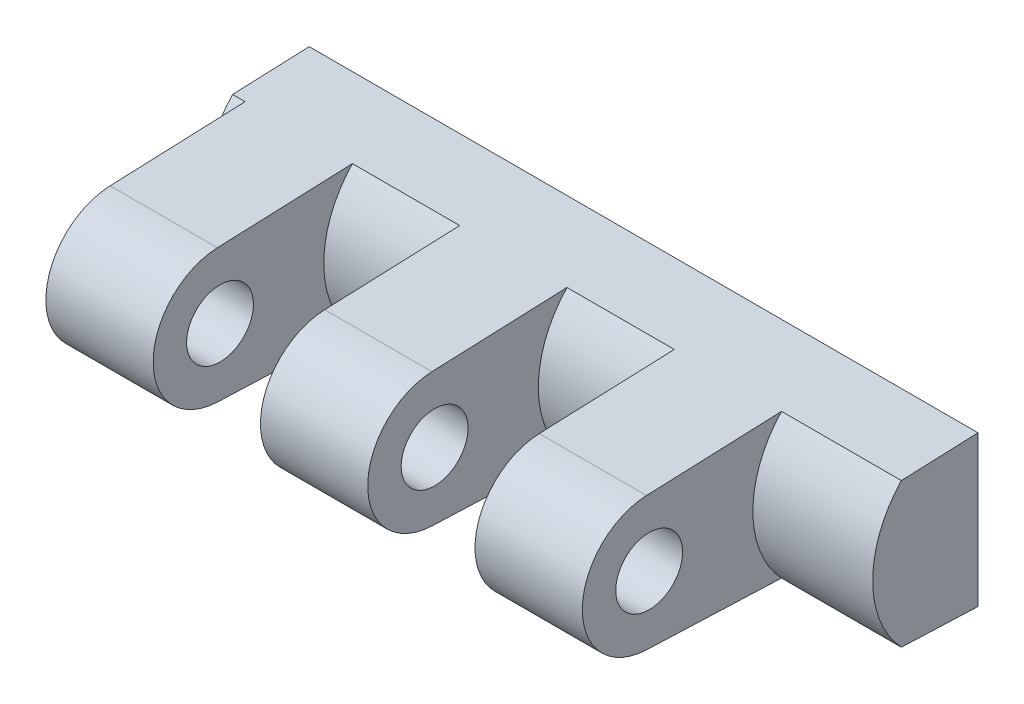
ISO-10303-21;
HEADER;
FILE_DESCRIPTION(('STEP AP214'),'2;1');
FILE_NAME('part.step','',(''),(''),'','','');
FILE_SCHEMA(('AUTOMOTIVE_DESIGN { 1 0 10303 214 1 1 1 1 }'));
ENDSEC;
DATA;
#1=APPLICATION_CONTEXT('core data for automotive mechanical design processes');
#2=APPLICATION_PROTOCOL_DEFINITION('international standard','automotive_design',2000,#1);
#3=PRODUCT_CONTEXT('',#1,'mechanical');
#4=PRODUCT('Part','Part','',(#3));
#5=PRODUCT_RELATED_PRODUCT_CATEGORY('part','',(#4));
#6=PRODUCT_DEFINITION_FORMATION('','',#4);
#7=PRODUCT_DEFINITION_CONTEXT('part definition',#1,'design');
#8=PRODUCT_DEFINITION('design','',#6,#7);
#9=PRODUCT_DEFINITION_SHAPE('','',#8);
#10=(LENGTH_UNIT() NAMED_UNIT(*) SI_UNIT(.MILLI.,.METRE.));
#11=(NAMED_UNIT(*) PLANE_ANGLE_UNIT() SI_UNIT($,.RADIAN.));
#12=(NAMED_UNIT(*) SI_UNIT($,.STERADIAN.) SOLID_ANGLE_UNIT());
#13=UNCERTAINTY_MEASURE_WITH_UNIT(LENGTH_MEASURE(1.E-05),#10,'distance_accuracy_value','');
#14=(GEOMETRIC_REPRESENTATION_CONTEXT(3) GLOBAL_UNCERTAINTY_ASSIGNED_CONTEXT((#13)) GLOBAL_UNIT_ASSIGNED_CONTEXT((#10,
#11,#12)) REPRESENTATION_CONTEXT('',''));
#15=CARTESIAN_POINT('',(0.,0.,0.));
#16=DIRECTION('',(0.,0.,1.));
#17=DIRECTION('',(1.,0.,0.));
#18=AXIS2_PLACEMENT_3D('',#15,#16,#17);
#19=CARTESIAN_POINT('',(-10.25,-4.5,0.));
#20=DIRECTION('',(0.,-0.99921100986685,0.0397159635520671));
#21=DIRECTION('',(0.,0.0397159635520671,0.999211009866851));
#22=AXIS2_PLACEMENT_3D('',#19,#20,#21);
#23=PLANE('',#22);
#24=DIRECTION('',(1.,0.,0.));
#25=VECTOR('',#24,1.);
#26=CARTESIAN_POINT('',(-40.,-4.31777704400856,4.58453396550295));
#27=LINE('',#26,#25);
#28=CARTESIAN_POINT('',(-10.,-4.31777704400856,4.58453396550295));
#29=VERTEX_POINT('',#28);
#30=CARTESIAN_POINT('',(-9.25,-4.31777704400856,4.58453396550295));
#31=VERTEX_POINT('',#30);
#32=EDGE_CURVE('E175',#29,#31,#27,.T.);
#33=ORIENTED_EDGE('',*,*,#32,.F.);
#34=DIRECTION('',(0.,0.0397159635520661,0.99921100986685));
#35=VECTOR('',#34,1.);
#36=CARTESIAN_POINT('',(-10.,-4.5,0.));
#37=LINE('',#36,#35);
#38=CARTESIAN_POINT('',(-10.,-4.5,0.));
#39=VERTEX_POINT('',#38);
#40=EDGE_CURVE('E29',#39,#29,#37,.T.);
#41=ORIENTED_EDGE('',*,*,#40,.F.);
#42=DIRECTION('',(1.,0.,0.));
#43=VECTOR('',#42,1.);
#44=CARTESIAN_POINT('',(-10.25,-4.5,0.));
#45=LINE('',#44,#43);
#46=CARTESIAN_POINT('',(30.,-4.5,0.));
#47=VERTEX_POINT('',#46);
#48=EDGE_CURVE('E202',#39,#47,#45,.T.);
#49=ORIENTED_EDGE('',*,*,#48,.T.);
#50=DIRECTION('',(0.,-0.0397159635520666,-0.99921100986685));
#51=VECTOR('',#50,1.);
#52=CARTESIAN_POINT('',(30.,-4.31777704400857,4.58453396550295));
#53=LINE('',#52,#51);
#54=CARTESIAN_POINT('',(30.,-4.31777704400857,4.58453396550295));
#55=VERTEX_POINT('',#54);
#56=EDGE_CURVE('E287',#55,#47,#53,.T.);
#57=ORIENTED_EDGE('',*,*,#56,.F.);
#58=DIRECTION('',(1.,0.,0.));
#59=VECTOR('',#58,1.);
#60=CARTESIAN_POINT('',(-40.,-4.31777704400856,4.58453396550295));
#61=LINE('',#60,#59);
#62=CARTESIAN_POINT('',(22.833333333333,-4.31777704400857,4.58453396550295));
#63=VERTEX_POINT('',#62);
#64=EDGE_CURVE('E172',#63,#55,#61,.T.);
#65=ORIENTED_EDGE('',*,*,#64,.F.);
#66=DIRECTION('',(0.,-0.0397159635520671,-0.999211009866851));
#67=VECTOR('',#66,1.);
#68=CARTESIAN_POINT('',(22.833333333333,-4.5,0.));
#69=LINE('',#68,#67);
#70=CARTESIAN_POINT('',(22.833333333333,-3.9968440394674,12.658863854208));
#71=VERTEX_POINT('',#70);
#72=EDGE_CURVE('E191',#71,#63,#69,.T.);
#73=ORIENTED_EDGE('',*,*,#72,.F.);
#74=DIRECTION('',(1.,0.,0.));
#75=VECTOR('',#74,1.);
#76=CARTESIAN_POINT('',(-10.25,-3.9968440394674,12.658863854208));
#77=LINE('',#76,#75);
#78=CARTESIAN_POINT('',(16.4166666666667,-3.9968440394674,12.658863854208));
#79=VERTEX_POINT('',#78);
#80=EDGE_CURVE('E198',#79,#71,#77,.T.);
#81=ORIENTED_EDGE('',*,*,#80,.F.);
#82=DIRECTION('',(0.,0.0397159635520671,0.999211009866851));
#83=VECTOR('',#82,1.);
#84=CARTESIAN_POINT('',(16.4166666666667,-4.5,0.));
#85=LINE('',#84,#83);
#86=CARTESIAN_POINT('',(16.4166666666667,-4.31777704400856,4.58453396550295));
#87=VERTEX_POINT('',#86);
#88=EDGE_CURVE('E188',#87,#79,#85,.T.);
#89=ORIENTED_EDGE('',*,*,#88,.F.);
#90=DIRECTION('',(1.,0.,0.));
#91=VECTOR('',#90,1.);
#92=CARTESIAN_POINT('',(-40.,-4.31777704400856,4.58453396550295));
#93=LINE('',#92,#91);
#94=CARTESIAN_POINT('',(10.,-4.31777704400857,4.58453396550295));
#95=VERTEX_POINT('',#94);
#96=EDGE_CURVE('E9',#95,#87,#93,.T.);
#97=ORIENTED_EDGE('',*,*,#96,.F.);
#98=DIRECTION('',(0.,-0.0397159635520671,-0.999211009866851));
#99=VECTOR('',#98,1.);
#100=CARTESIAN_POINT('',(10.,-4.5,0.));
#101=LINE('',#100,#99);
#102=CARTESIAN_POINT('',(10.,-3.9968440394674,12.658863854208));
#103=VERTEX_POINT('',#102);
#104=EDGE_CURVE('E185',#103,#95,#101,.T.);
#105=ORIENTED_EDGE('',*,*,#104,.F.);
#106=CARTESIAN_POINT('',(3.5833333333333,-3.9968440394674,12.658863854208));
#107=VERTEX_POINT('',#106);
#108=EDGE_CURVE('E200',#107,#103,#77,.T.);
#109=ORIENTED_EDGE('',*,*,#108,.F.);
#110=DIRECTION('',(0.,0.0397159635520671,0.999211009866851));
#111=VECTOR('',#110,1.);
#112=CARTESIAN_POINT('',(3.5833333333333,-4.5,0.));
#113=LINE('',#112,#111);
#114=CARTESIAN_POINT('',(3.5833333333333,-4.31777704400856,4.58453396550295));
#115=VERTEX_POINT('',#114);
#116=EDGE_CURVE('E183',#115,#107,#113,.T.);
#117=ORIENTED_EDGE('',*,*,#116,.F.);
#118=DIRECTION('',(1.,0.,0.));
#119=VECTOR('',#118,1.);
#120=CARTESIAN_POINT('',(-40.,-4.31777704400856,4.58453396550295));
#121=LINE('',#120,#119);
#122=CARTESIAN_POINT('',(-2.833333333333,-4.31777704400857,4.58453396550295));
#123=VERTEX_POINT('',#122);
#124=EDGE_CURVE('E22',#123,#115,#121,.T.);
#125=ORIENTED_EDGE('',*,*,#124,.F.);
#126=DIRECTION('',(0.,-0.0397159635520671,-0.999211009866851));
#127=VECTOR('',#126,1.);
#128=CARTESIAN_POINT('',(-2.833333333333,-4.5,0.));
#129=LINE('',#128,#127);
#130=CARTESIAN_POINT('',(-2.833333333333,-3.9968440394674,12.658863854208));
#131=VERTEX_POINT('',#130);
#132=EDGE_CURVE('E180',#131,#123,#129,.T.);
#133=ORIENTED_EDGE('',*,*,#132,.F.);
#134=CARTESIAN_POINT('',(-9.25,-3.9968440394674,12.658863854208));
#135=VERTEX_POINT('',#134);
#136=EDGE_CURVE('E201',#135,#131,#77,.T.);
#137=ORIENTED_EDGE('',*,*,#136,.F.);
#138=DIRECTION('',(0.,0.0397159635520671,0.999211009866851));
#139=VECTOR('',#138,1.);
#140=CARTESIAN_POINT('',(-9.25,-4.5,0.));
#141=LINE('',#140,#139);
#142=EDGE_CURVE('E177',#31,#135,#141,.T.);
#143=ORIENTED_EDGE('',*,*,#142,.F.);
#144=EDGE_LOOP('',(#33,#41,#49,#57,#65,#73,#81,#89,#97,#105,#109,#117,#125,#133,#137,#143));
#145=FACE_BOUND('',#144,.T.);
#146=ADVANCED_FACE('F14',(#145),#23,.T.);
#147=CARTESIAN_POINT('',(-10.25,3.9968440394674,12.658863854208));
#148=DIRECTION('',(0.,0.99921100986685,0.0397159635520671));
#149=DIRECTION('',(0.,0.0397159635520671,-0.999211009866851));
#150=AXIS2_PLACEMENT_3D('',#147,#148,#149);
#151=PLANE('',#150);
#152=DIRECTION('',(1.,0.,0.));
#153=VECTOR('',#152,1.);
#154=CARTESIAN_POINT('',(-10.25,4.5,0.));
#155=LINE('',#154,#153);
#156=CARTESIAN_POINT('',(-10.,4.5,0.));
#157=VERTEX_POINT('',#156);
#158=CARTESIAN_POINT('',(30.,4.5,0.));
#159=VERTEX_POINT('',#158);
#160=EDGE_CURVE('E137',#157,#159,#155,.T.);
#161=ORIENTED_EDGE('',*,*,#160,.F.);
#162=DIRECTION('',(0.,0.0397159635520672,-0.99921100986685));
#163=VECTOR('',#162,1.);
#164=CARTESIAN_POINT('',(-10.,4.31777704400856,4.58453396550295));
#165=LINE('',#164,#163);
#166=CARTESIAN_POINT('',(-10.,4.31777704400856,4.58453396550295));
#167=VERTEX_POINT('',#166);
#168=EDGE_CURVE('E127',#167,#157,#165,.T.);
#169=ORIENTED_EDGE('',*,*,#168,.F.);
#170=DIRECTION('',(-1.,0.,0.));
#171=VECTOR('',#170,1.);
#172=CARTESIAN_POINT('',(-40.,4.31777704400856,4.58453396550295));
#173=LINE('',#172,#171);
#174=CARTESIAN_POINT('',(-9.25,4.31777704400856,4.58453396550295));
#175=VERTEX_POINT('',#174);
#176=EDGE_CURVE('E135',#167,#175,#173,.F.);
#177=ORIENTED_EDGE('',*,*,#176,.T.);
#178=DIRECTION('',(0.,-0.0397159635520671,0.999211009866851));
#179=VECTOR('',#178,1.);
#180=CARTESIAN_POINT('',(-9.25,3.9968440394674,12.658863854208));
#181=LINE('',#180,#179);
#182=CARTESIAN_POINT('',(-9.25,3.9968440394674,12.658863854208));
#183=VERTEX_POINT('',#182);
#184=EDGE_CURVE('E144',#175,#183,#181,.T.);
#185=ORIENTED_EDGE('',*,*,#184,.T.);
#186=DIRECTION('',(1.,0.,0.));
#187=VECTOR('',#186,1.);
#188=CARTESIAN_POINT('',(-10.25,3.9968440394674,12.658863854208));
#189=LINE('',#188,#187);
#190=CARTESIAN_POINT('',(-2.833333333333,3.9968440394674,12.658863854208));
#191=VERTEX_POINT('',#190);
#192=EDGE_CURVE('E197',#183,#191,#189,.T.);
#193=ORIENTED_EDGE('',*,*,#192,.T.);
#194=DIRECTION('',(0.,0.0397159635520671,-0.999211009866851));
#195=VECTOR('',#194,1.);
#196=CARTESIAN_POINT('',(-2.833333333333,3.9968440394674,12.658863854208));
#197=LINE('',#196,#195);
#198=CARTESIAN_POINT('',(-2.833333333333,4.31777704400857,4.58453396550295));
#199=VERTEX_POINT('',#198);
#200=EDGE_CURVE('E237',#191,#199,#197,.T.);
#201=ORIENTED_EDGE('',*,*,#200,.T.);
#202=DIRECTION('',(-1.,0.,0.));
#203=VECTOR('',#202,1.);
#204=CARTESIAN_POINT('',(-40.,4.31777704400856,4.58453396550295));
#205=LINE('',#204,#203);
#206=CARTESIAN_POINT('',(3.5833333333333,4.31777704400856,4.58453396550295));
#207=VERTEX_POINT('',#206);
#208=EDGE_CURVE('E145',#199,#207,#205,.F.);
#209=ORIENTED_EDGE('',*,*,#208,.T.);
#210=DIRECTION('',(0.,-0.0397159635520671,0.999211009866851));
#211=VECTOR('',#210,1.);
#212=CARTESIAN_POINT('',(3.5833333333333,3.9968440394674,12.658863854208));
#213=LINE('',#212,#211);
#214=CARTESIAN_POINT('',(3.5833333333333,3.9968440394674,12.658863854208));
#215=VERTEX_POINT('',#214);
#216=EDGE_CURVE('E150',#207,#215,#213,.T.);
#217=ORIENTED_EDGE('',*,*,#216,.T.);
#218=CARTESIAN_POINT('',(10.,3.9968440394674,12.658863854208));
#219=VERTEX_POINT('',#218);
#220=EDGE_CURVE('E196',#215,#219,#189,.T.);
#221=ORIENTED_EDGE('',*,*,#220,.T.);
#222=DIRECTION('',(0.,0.0397159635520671,-0.999211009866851));
#223=VECTOR('',#222,1.);
#224=CARTESIAN_POINT('',(10.,3.9968440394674,12.658863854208));
#225=LINE('',#224,#223);
#226=CARTESIAN_POINT('',(10.,4.31777704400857,4.58453396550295));
#227=VERTEX_POINT('',#226);
#228=EDGE_CURVE('E246',#219,#227,#225,.T.);
#229=ORIENTED_EDGE('',*,*,#228,.T.);
#230=DIRECTION('',(-1.,0.,0.));
#231=VECTOR('',#230,1.);
#232=CARTESIAN_POINT('',(-40.,4.31777704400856,4.58453396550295));
#233=LINE('',#232,#231);
#234=CARTESIAN_POINT('',(16.4166666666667,4.31777704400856,4.58453396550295));
#235=VERTEX_POINT('',#234);
#236=EDGE_CURVE('E251',#227,#235,#233,.F.);
#237=ORIENTED_EDGE('',*,*,#236,.T.);
#238=DIRECTION('',(0.,-0.0397159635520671,0.999211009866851));
#239=VECTOR('',#238,1.);
#240=CARTESIAN_POINT('',(16.4166666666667,3.9968440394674,12.658863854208));
#241=LINE('',#240,#239);
#242=CARTESIAN_POINT('',(16.4166666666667,3.9968440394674,12.658863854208));
#243=VERTEX_POINT('',#242);
#244=EDGE_CURVE('E243',#235,#243,#241,.T.);
#245=ORIENTED_EDGE('',*,*,#244,.T.);
#246=CARTESIAN_POINT('',(22.833333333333,3.9968440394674,12.658863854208));
#247=VERTEX_POINT('',#246);
#248=EDGE_CURVE('E194',#243,#247,#189,.T.);
#249=ORIENTED_EDGE('',*,*,#248,.T.);
#250=DIRECTION('',(0.,0.0397159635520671,-0.999211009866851));
#251=VECTOR('',#250,1.);
#252=CARTESIAN_POINT('',(22.833333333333,3.9968440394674,12.658863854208));
#253=LINE('',#252,#251);
#254=CARTESIAN_POINT('',(22.833333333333,4.31777704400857,4.58453396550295));
#255=VERTEX_POINT('',#254);
#256=EDGE_CURVE('E156',#247,#255,#253,.T.);
#257=ORIENTED_EDGE('',*,*,#256,.T.);
#258=DIRECTION('',(-1.,0.,0.));
#259=VECTOR('',#258,1.);
#260=CARTESIAN_POINT('',(-40.,4.31777704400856,4.58453396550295));
#261=LINE('',#260,#259);
#262=CARTESIAN_POINT('',(30.,4.31777704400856,4.58453396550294));
#263=VERTEX_POINT('',#262);
#264=EDGE_CURVE('E147',#255,#263,#261,.F.);
#265=ORIENTED_EDGE('',*,*,#264,.T.);
#266=DIRECTION('',(0.,-0.0397159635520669,0.99921100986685));
#267=VECTOR('',#266,1.);
#268=CARTESIAN_POINT('',(30.,4.5,0.));
#269=LINE('',#268,#267);
#270=EDGE_CURVE('E37',#159,#263,#269,.T.);
#271=ORIENTED_EDGE('',*,*,#270,.F.);
#272=EDGE_LOOP('',(#161,#169,#177,#185,#193,#201,#209,#217,#221,#229,#237,#245,#249,#257,#265,#271));
#273=FACE_BOUND('',#272,.T.);
#274=ADVANCED_FACE('F16',(#273),#151,.T.);
#275=CARTESIAN_POINT('',(-10.25,4.5,0.));
#276=DIRECTION('',(0.,0.,-1.));
#277=DIRECTION('',(-1.,0.,0.));
#278=AXIS2_PLACEMENT_3D('',#275,#276,#277);
#279=PLANE('',#278);
#280=CARTESIAN_POINT('',(0.,0.,0.));
#281=DIRECTION('',(0.,0.,1.));
#282=DIRECTION('',(-1.,0.,0.));
#283=AXIS2_PLACEMENT_3D('',#280,#281,#282);
#284=CIRCLE('',#283,2.);
#285=CARTESIAN_POINT('',(-2.,0.,0.));
#286=VERTEX_POINT('',#285);
#287=EDGE_CURVE('E279',#286,#286,#284,.T.);
#288=ORIENTED_EDGE('',*,*,#287,.T.);
#289=EDGE_LOOP('',(#288));
#290=FACE_BOUND('',#289,.T.);
#291=CARTESIAN_POINT('',(20.,0.,0.));
#292=DIRECTION('',(0.,0.,1.));
#293=DIRECTION('',(-1.,0.,0.));
#294=AXIS2_PLACEMENT_3D('',#291,#292,#293);
#295=CIRCLE('',#294,2.);
#296=CARTESIAN_POINT('',(18.,0.,0.));
#297=VERTEX_POINT('',#296);
#298=EDGE_CURVE('E273',#297,#297,#295,.T.);
#299=ORIENTED_EDGE('',*,*,#298,.T.);
#300=EDGE_LOOP('',(#299));
#301=FACE_BOUND('',#300,.T.);
#302=ORIENTED_EDGE('',*,*,#48,.F.);
#303=DIRECTION('',(0.,-1.,0.));
#304=VECTOR('',#303,1.);
#305=CARTESIAN_POINT('',(-10.,4.5,0.));
#306=LINE('',#305,#304);
#307=EDGE_CURVE('E138',#157,#39,#306,.T.);
#308=ORIENTED_EDGE('',*,*,#307,.F.);
#309=ORIENTED_EDGE('',*,*,#160,.T.);
#310=DIRECTION('',(0.,1.,0.));
#311=VECTOR('',#310,1.);
#312=CARTESIAN_POINT('',(30.,-4.5,0.));
#313=LINE('',#312,#311);
#314=EDGE_CURVE('E285',#47,#159,#313,.T.);
#315=ORIENTED_EDGE('',*,*,#314,.F.);
#316=EDGE_LOOP('',(#302,#308,#309,#315));
#317=FACE_BOUND('',#316,.T.);
#318=ADVANCED_FACE('F298',(#290,#301,#317),#279,.T.);
#319=CARTESIAN_POINT('',(-40.,0.,0.));
#320=DIRECTION('',(1.,0.,0.));
#321=DIRECTION('',(0.,-1.,0.));
#322=AXIS2_PLACEMENT_3D('',#319,#320,#321);
#323=CYLINDRICAL_SURFACE('',#322,6.2977099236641);
#324=ORIENTED_EDGE('',*,*,#176,.F.);
#325=CARTESIAN_POINT('',(-10.,0.,0.));
#326=DIRECTION('',(-1.,0.,0.));
#327=DIRECTION('',(0.,0.,1.));
#328=AXIS2_PLACEMENT_3D('',#325,#326,#327);
#329=CIRCLE('',#328,6.29770992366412);
#330=EDGE_CURVE('E124',#29,#167,#329,.T.);
#331=ORIENTED_EDGE('',*,*,#330,.F.);
#332=ORIENTED_EDGE('',*,*,#32,.T.);
#333=CARTESIAN_POINT('',(-9.25,0.,0.));
#334=DIRECTION('',(-1.,0.,0.));
#335=DIRECTION('',(0.,-1.,0.));
#336=AXIS2_PLACEMENT_3D('',#333,#334,#335);
#337=CIRCLE('',#336,6.2977099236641);
#338=EDGE_CURVE('E142',#31,#175,#337,.T.);
#339=ORIENTED_EDGE('',*,*,#338,.T.);
#340=EDGE_LOOP('',(#324,#331,#332,#339));
#341=FACE_BOUND('',#340,.T.);
#342=ADVANCED_FACE('F140',(#341),#323,.T.);
#343=CARTESIAN_POINT('',(-40.,0.,0.));
#344=DIRECTION('',(1.,0.,0.));
#345=DIRECTION('',(0.,-1.,0.));
#346=AXIS2_PLACEMENT_3D('',#343,#344,#345);
#347=CYLINDRICAL_SURFACE('',#346,6.2977099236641);
#348=ORIENTED_EDGE('',*,*,#64,.T.);
#349=CARTESIAN_POINT('',(30.,0.,0.));
#350=DIRECTION('',(1.,0.,0.));
#351=DIRECTION('',(0.,0.,-1.));
#352=AXIS2_PLACEMENT_3D('',#349,#350,#351);
#353=CIRCLE('',#352,6.29770992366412);
#354=EDGE_CURVE('E290',#263,#55,#353,.T.);
#355=ORIENTED_EDGE('',*,*,#354,.F.);
#356=ORIENTED_EDGE('',*,*,#264,.F.);
#357=CARTESIAN_POINT('',(22.833333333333,0.,0.));
#358=DIRECTION('',(-1.,0.,0.));
#359=DIRECTION('',(0.,-1.,0.));
#360=AXIS2_PLACEMENT_3D('',#357,#358,#359);
#361=CIRCLE('',#360,6.2977099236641);
#362=EDGE_CURVE('E169',#63,#255,#361,.T.);
#363=ORIENTED_EDGE('',*,*,#362,.F.);
#364=EDGE_LOOP('',(#348,#355,#356,#363));
#365=FACE_BOUND('',#364,.T.);
#366=ADVANCED_FACE('F303',(#365),#347,.T.);
#367=CARTESIAN_POINT('',(22.833333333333,-6.2977099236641,0.));
#368=DIRECTION('',(1.,0.,0.));
#369=DIRECTION('',(0.,-1.,0.));
#370=AXIS2_PLACEMENT_3D('',#367,#368,#369);
#371=PLANE('',#370);
#372=CARTESIAN_POINT('',(22.833333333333,0.,12.5));
#373=DIRECTION('',(-1.,0.,0.));
#374=DIRECTION('',(0.,-1.,0.));
#375=AXIS2_PLACEMENT_3D('',#372,#373,#374);
#376=CIRCLE('',#375,4.);
#377=EDGE_CURVE('E219',#247,#71,#376,.F.);
#378=ORIENTED_EDGE('',*,*,#377,.T.);
#379=ORIENTED_EDGE('',*,*,#72,.T.);
#380=ORIENTED_EDGE('',*,*,#362,.T.);
#381=ORIENTED_EDGE('',*,*,#256,.F.);
#382=EDGE_LOOP('',(#378,#379,#380,#381));
#383=FACE_BOUND('',#382,.T.);
#384=CARTESIAN_POINT('',(22.833333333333,0.,12.5));
#385=DIRECTION('',(-1.,0.,0.));
#386=DIRECTION('',(0.,-1.,0.));
#387=AXIS2_PLACEMENT_3D('',#384,#385,#386);
#388=CIRCLE('',#387,2.);
#389=CARTESIAN_POINT('',(22.833333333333,-2.,12.5));
#390=VERTEX_POINT('',#389);
#391=EDGE_CURVE('E266',#390,#390,#388,.F.);
#392=ORIENTED_EDGE('',*,*,#391,.F.);
#393=EDGE_LOOP('',(#392));
#394=FACE_BOUND('',#393,.T.);
#395=ADVANCED_FACE('F309',(#383,#394),#371,.T.);
#396=CARTESIAN_POINT('',(16.4166666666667,-19.8,0.));
#397=DIRECTION('',(-1.,0.,0.));
#398=DIRECTION('',(0.,1.,0.));
#399=AXIS2_PLACEMENT_3D('',#396,#397,#398);
#400=PLANE('',#399);
#401=CARTESIAN_POINT('',(16.4166666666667,0.,0.));
#402=DIRECTION('',(-1.,0.,0.));
#403=DIRECTION('',(0.,-1.,0.));
#404=AXIS2_PLACEMENT_3D('',#401,#402,#403);
#405=CIRCLE('',#404,6.2977099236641);
#406=EDGE_CURVE('E166',#87,#235,#405,.T.);
#407=ORIENTED_EDGE('',*,*,#406,.F.);
#408=ORIENTED_EDGE('',*,*,#88,.T.);
#409=CARTESIAN_POINT('',(16.4166666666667,0.,12.5));
#410=DIRECTION('',(1.,0.,0.));
#411=DIRECTION('',(0.,1.,0.));
#412=AXIS2_PLACEMENT_3D('',#409,#410,#411);
#413=CIRCLE('',#412,4.);
#414=EDGE_CURVE('E216',#79,#243,#413,.F.);
#415=ORIENTED_EDGE('',*,*,#414,.T.);
#416=ORIENTED_EDGE('',*,*,#244,.F.);
#417=EDGE_LOOP('',(#407,#408,#415,#416));
#418=FACE_BOUND('',#417,.T.);
#419=CARTESIAN_POINT('',(16.4166666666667,0.,12.5));
#420=DIRECTION('',(1.,0.,0.));
#421=DIRECTION('',(0.,1.,0.));
#422=AXIS2_PLACEMENT_3D('',#419,#420,#421);
#423=CIRCLE('',#422,2.);
#424=CARTESIAN_POINT('',(16.4166666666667,2.,12.5));
#425=VERTEX_POINT('',#424);
#426=EDGE_CURVE('E269',#425,#425,#423,.F.);
#427=ORIENTED_EDGE('',*,*,#426,.F.);
#428=EDGE_LOOP('',(#427));
#429=FACE_BOUND('',#428,.T.);
#430=ADVANCED_FACE('F316',(#418,#429),#400,.T.);
#431=CARTESIAN_POINT('',(-10.25,0.,12.5));
#432=DIRECTION('',(1.,0.,0.));
#433=DIRECTION('',(0.,-1.,0.));
#434=AXIS2_PLACEMENT_3D('',#431,#432,#433);
#435=CYLINDRICAL_SURFACE('',#434,4.);
#436=ORIENTED_EDGE('',*,*,#248,.F.);
#437=ORIENTED_EDGE('',*,*,#414,.F.);
#438=ORIENTED_EDGE('',*,*,#80,.T.);
#439=ORIENTED_EDGE('',*,*,#377,.F.);
#440=EDGE_LOOP('',(#436,#437,#438,#439));
#441=FACE_BOUND('',#440,.T.);
#442=ADVANCED_FACE('F312',(#441),#435,.T.);
#443=ORIENTED_EDGE('',*,*,#220,.F.);
#444=CARTESIAN_POINT('',(3.5833333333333,0.,12.5));
#445=DIRECTION('',(1.,0.,0.));
#446=DIRECTION('',(0.,1.,0.));
#447=AXIS2_PLACEMENT_3D('',#444,#445,#446);
#448=CIRCLE('',#447,4.);
#449=EDGE_CURVE('E210',#107,#215,#448,.F.);
#450=ORIENTED_EDGE('',*,*,#449,.F.);
#451=ORIENTED_EDGE('',*,*,#108,.T.);
#452=CARTESIAN_POINT('',(10.,0.,12.5));
#453=DIRECTION('',(-1.,0.,0.));
#454=DIRECTION('',(0.,-1.,0.));
#455=AXIS2_PLACEMENT_3D('',#452,#453,#454);
#456=CIRCLE('',#455,4.);
#457=EDGE_CURVE('E213',#219,#103,#456,.F.);
#458=ORIENTED_EDGE('',*,*,#457,.F.);
#459=EDGE_LOOP('',(#443,#450,#451,#458));
#460=FACE_BOUND('',#459,.T.);
#461=ADVANCED_FACE('F326',(#460),#435,.T.);
#462=ORIENTED_EDGE('',*,*,#192,.F.);
#463=CARTESIAN_POINT('',(-9.25,0.,12.5));
#464=DIRECTION('',(1.,0.,0.));
#465=DIRECTION('',(0.,1.,0.));
#466=AXIS2_PLACEMENT_3D('',#463,#464,#465);
#467=CIRCLE('',#466,4.);
#468=EDGE_CURVE('E205',#135,#183,#467,.F.);
#469=ORIENTED_EDGE('',*,*,#468,.F.);
#470=ORIENTED_EDGE('',*,*,#136,.T.);
#471=CARTESIAN_POINT('',(-2.833333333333,0.,12.5));
#472=DIRECTION('',(-1.,0.,0.));
#473=DIRECTION('',(0.,-1.,0.));
#474=AXIS2_PLACEMENT_3D('',#471,#472,#473);
#475=CIRCLE('',#474,4.);
#476=EDGE_CURVE('E208',#191,#131,#475,.F.);
#477=ORIENTED_EDGE('',*,*,#476,.F.);
#478=EDGE_LOOP('',(#462,#469,#470,#477));
#479=FACE_BOUND('',#478,.T.);
#480=ADVANCED_FACE('F330',(#479),#435,.T.);
#481=CARTESIAN_POINT('',(-9.25,-19.8,0.));
#482=DIRECTION('',(-1.,0.,0.));
#483=DIRECTION('',(0.,1.,0.));
#484=AXIS2_PLACEMENT_3D('',#481,#482,#483);
#485=PLANE('',#484);
#486=CARTESIAN_POINT('',(-9.25,0.,12.5));
#487=DIRECTION('',(1.,0.,0.));
#488=DIRECTION('',(0.,1.,0.));
#489=AXIS2_PLACEMENT_3D('',#486,#487,#488);
#490=CIRCLE('',#489,2.);
#491=CARTESIAN_POINT('',(-9.25,2.,12.5));
#492=VERTEX_POINT('',#491);
#493=EDGE_CURVE('E253',#492,#492,#490,.T.);
#494=ORIENTED_EDGE('',*,*,#493,.T.);
#495=EDGE_LOOP('',(#494));
#496=FACE_BOUND('',#495,.T.);
#497=ORIENTED_EDGE('',*,*,#338,.F.);
#498=ORIENTED_EDGE('',*,*,#142,.T.);
#499=ORIENTED_EDGE('',*,*,#468,.T.);
#500=ORIENTED_EDGE('',*,*,#184,.F.);
#501=EDGE_LOOP('',(#497,#498,#499,#500));
#502=FACE_BOUND('',#501,.T.);
#503=ADVANCED_FACE('F333',(#496,#502),#485,.T.);
#504=CARTESIAN_POINT('',(-2.833333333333,-6.2977099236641,0.));
#505=DIRECTION('',(1.,0.,0.));
#506=DIRECTION('',(0.,-1.,0.));
#507=AXIS2_PLACEMENT_3D('',#504,#505,#506);
#508=PLANE('',#507);
#509=CARTESIAN_POINT('',(-2.833333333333,0.,12.5));
#510=DIRECTION('',(-1.,0.,0.));
#511=DIRECTION('',(0.,-1.,0.));
#512=AXIS2_PLACEMENT_3D('',#509,#510,#511);
#513=CIRCLE('',#512,2.);
#514=CARTESIAN_POINT('',(-2.833333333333,-2.,12.5));
#515=VERTEX_POINT('',#514);
#516=EDGE_CURVE('E256',#515,#515,#513,.T.);
#517=ORIENTED_EDGE('',*,*,#516,.T.);
#518=EDGE_LOOP('',(#517));
#519=FACE_BOUND('',#518,.T.);
#520=ORIENTED_EDGE('',*,*,#476,.T.);
#521=ORIENTED_EDGE('',*,*,#132,.T.);
#522=CARTESIAN_POINT('',(-2.833333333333,0.,0.));
#523=DIRECTION('',(-1.,0.,0.));
#524=DIRECTION('',(0.,-1.,0.));
#525=AXIS2_PLACEMENT_3D('',#522,#523,#524);
#526=CIRCLE('',#525,6.2977099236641);
#527=EDGE_CURVE('E160',#123,#199,#526,.T.);
#528=ORIENTED_EDGE('',*,*,#527,.T.);
#529=ORIENTED_EDGE('',*,*,#200,.F.);
#530=EDGE_LOOP('',(#520,#521,#528,#529));
#531=FACE_BOUND('',#530,.T.);
#532=ADVANCED_FACE('F331',(#519,#531),#508,.T.);
#533=CARTESIAN_POINT('',(3.5833333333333,-19.8,0.));
#534=DIRECTION('',(-1.,0.,0.));
#535=DIRECTION('',(0.,1.,0.));
#536=AXIS2_PLACEMENT_3D('',#533,#534,#535);
#537=PLANE('',#536);
#538=CARTESIAN_POINT('',(3.5833333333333,0.,12.5));
#539=DIRECTION('',(1.,0.,0.));
#540=DIRECTION('',(0.,1.,0.));
#541=AXIS2_PLACEMENT_3D('',#538,#539,#540);
#542=CIRCLE('',#541,2.);
#543=CARTESIAN_POINT('',(3.5833333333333,2.,12.5));
#544=VERTEX_POINT('',#543);
#545=EDGE_CURVE('E259',#544,#544,#542,.T.);
#546=ORIENTED_EDGE('',*,*,#545,.T.);
#547=EDGE_LOOP('',(#546));
#548=FACE_BOUND('',#547,.T.);
#549=CARTESIAN_POINT('',(3.5833333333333,0.,0.));
#550=DIRECTION('',(-1.,0.,0.));
#551=DIRECTION('',(0.,-1.,0.));
#552=AXIS2_PLACEMENT_3D('',#549,#550,#551);
#553=CIRCLE('',#552,6.2977099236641);
#554=EDGE_CURVE('E162',#115,#207,#553,.T.);
#555=ORIENTED_EDGE('',*,*,#554,.F.);
#556=ORIENTED_EDGE('',*,*,#116,.T.);
#557=ORIENTED_EDGE('',*,*,#449,.T.);
#558=ORIENTED_EDGE('',*,*,#216,.F.);
#559=EDGE_LOOP('',(#555,#556,#557,#558));
#560=FACE_BOUND('',#559,.T.);
#561=ADVANCED_FACE('F234',(#548,#560),#537,.T.);
#562=CARTESIAN_POINT('',(-40.,0.,0.));
#563=DIRECTION('',(1.,0.,0.));
#564=DIRECTION('',(0.,-1.,0.));
#565=AXIS2_PLACEMENT_3D('',#562,#563,#564);
#566=CYLINDRICAL_SURFACE('',#565,6.2977099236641);
#567=ORIENTED_EDGE('',*,*,#527,.F.);
#568=ORIENTED_EDGE('',*,*,#124,.T.);
#569=ORIENTED_EDGE('',*,*,#554,.T.);
#570=ORIENTED_EDGE('',*,*,#208,.F.);
#571=EDGE_LOOP('',(#567,#568,#569,#570));
#572=FACE_BOUND('',#571,.T.);
#573=ADVANCED_FACE('F225',(#572),#566,.T.);
#574=CARTESIAN_POINT('',(-40.,0.,0.));
#575=DIRECTION('',(1.,0.,0.));
#576=DIRECTION('',(0.,-1.,0.));
#577=AXIS2_PLACEMENT_3D('',#574,#575,#576);
#578=CYLINDRICAL_SURFACE('',#577,6.2977099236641);
#579=CARTESIAN_POINT('',(10.,0.,0.));
#580=DIRECTION('',(-1.,0.,0.));
#581=DIRECTION('',(0.,-1.,0.));
#582=AXIS2_PLACEMENT_3D('',#579,#580,#581);
#583=CIRCLE('',#582,6.2977099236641);
#584=EDGE_CURVE('E164',#95,#227,#583,.T.);
#585=ORIENTED_EDGE('',*,*,#584,.F.);
#586=ORIENTED_EDGE('',*,*,#96,.T.);
#587=ORIENTED_EDGE('',*,*,#406,.T.);
#588=ORIENTED_EDGE('',*,*,#236,.F.);
#589=EDGE_LOOP('',(#585,#586,#587,#588));
#590=FACE_BOUND('',#589,.T.);
#591=ADVANCED_FACE('F320',(#590),#578,.T.);
#592=CARTESIAN_POINT('',(10.,-6.2977099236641,0.));
#593=DIRECTION('',(1.,0.,0.));
#594=DIRECTION('',(0.,-1.,0.));
#595=AXIS2_PLACEMENT_3D('',#592,#593,#594);
#596=PLANE('',#595);
#597=CARTESIAN_POINT('',(10.,0.,12.5));
#598=DIRECTION('',(-1.,0.,0.));
#599=DIRECTION('',(0.,-1.,0.));
#600=AXIS2_PLACEMENT_3D('',#597,#598,#599);
#601=CIRCLE('',#600,2.);
#602=CARTESIAN_POINT('',(10.,-2.,12.5));
#603=VERTEX_POINT('',#602);
#604=EDGE_CURVE('E262',#603,#603,#601,.T.);
#605=ORIENTED_EDGE('',*,*,#604,.T.);
#606=EDGE_LOOP('',(#605));
#607=FACE_BOUND('',#606,.T.);
#608=ORIENTED_EDGE('',*,*,#457,.T.);
#609=ORIENTED_EDGE('',*,*,#104,.T.);
#610=ORIENTED_EDGE('',*,*,#584,.T.);
#611=ORIENTED_EDGE('',*,*,#228,.F.);
#612=EDGE_LOOP('',(#608,#609,#610,#611));
#613=FACE_BOUND('',#612,.T.);
#614=ADVANCED_FACE('F323',(#607,#613),#596,.T.);
#615=CARTESIAN_POINT('',(-10.25,0.,12.5));
#616=DIRECTION('',(1.,0.,0.));
#617=DIRECTION('',(0.,-1.,0.));
#618=AXIS2_PLACEMENT_3D('',#615,#616,#617);
#619=CYLINDRICAL_SURFACE('',#618,2.);
#620=ORIENTED_EDGE('',*,*,#545,.F.);
#621=EDGE_LOOP('',(#620));
#622=FACE_BOUND('',#621,.T.);
#623=ORIENTED_EDGE('',*,*,#604,.F.);
#624=EDGE_LOOP('',(#623));
#625=FACE_BOUND('',#624,.T.);
#626=ADVANCED_FACE('F390',(#622,#625),#619,.F.);
#627=ORIENTED_EDGE('',*,*,#493,.F.);
#628=EDGE_LOOP('',(#627));
#629=FACE_BOUND('',#628,.T.);
#630=ORIENTED_EDGE('',*,*,#516,.F.);
#631=EDGE_LOOP('',(#630));
#632=FACE_BOUND('',#631,.T.);
#633=ADVANCED_FACE('F380',(#629,#632),#619,.F.);
#634=CARTESIAN_POINT('',(30.25,0.,12.5));
#635=DIRECTION('',(-1.,0.,0.));
#636=DIRECTION('',(0.,1.,0.));
#637=AXIS2_PLACEMENT_3D('',#634,#635,#636);
#638=CYLINDRICAL_SURFACE('',#637,2.);
#639=ORIENTED_EDGE('',*,*,#391,.T.);
#640=EDGE_LOOP('',(#639));
#641=FACE_BOUND('',#640,.T.);
#642=ORIENTED_EDGE('',*,*,#426,.T.);
#643=EDGE_LOOP('',(#642));
#644=FACE_BOUND('',#643,.T.);
#645=ADVANCED_FACE('F369',(#641,#644),#638,.F.);
#646=CARTESIAN_POINT('',(20.,0.,5.5));
#647=DIRECTION('',(0.,0.,-1.));
#648=DIRECTION('',(-1.,0.,0.));
#649=AXIS2_PLACEMENT_3D('',#646,#647,#648);
#650=CYLINDRICAL_SURFACE('',#649,2.);
#651=CARTESIAN_POINT('',(20.,0.,5.5));
#652=DIRECTION('',(0.,0.,1.));
#653=DIRECTION('',(-1.,0.,0.));
#654=AXIS2_PLACEMENT_3D('',#651,#652,#653);
#655=CIRCLE('',#654,2.);
#656=CARTESIAN_POINT('',(18.,0.,5.5));
#657=VERTEX_POINT('',#656);
#658=EDGE_CURVE('E272',#657,#657,#655,.T.);
#659=ORIENTED_EDGE('',*,*,#658,.T.);
#660=EDGE_LOOP('',(#659));
#661=FACE_BOUND('',#660,.T.);
#662=ORIENTED_EDGE('',*,*,#298,.F.);
#663=EDGE_LOOP('',(#662));
#664=FACE_BOUND('',#663,.T.);
#665=ADVANCED_FACE('F366',(#661,#664),#650,.F.);
#666=CARTESIAN_POINT('',(20.,0.,5.5));
#667=DIRECTION('',(0.,0.,1.));
#668=DIRECTION('',(0.,1.,0.));
#669=AXIS2_PLACEMENT_3D('',#666,#667,#668);
#670=PLANE('',#669);
#671=ORIENTED_EDGE('',*,*,#658,.F.);
#672=EDGE_LOOP('',(#671));
#673=FACE_BOUND('',#672,.T.);
#674=ADVANCED_FACE('F368',(#673),#670,.F.);
#675=CARTESIAN_POINT('',(0.,0.,5.5));
#676=DIRECTION('',(0.,0.,-1.));
#677=DIRECTION('',(-1.,0.,0.));
#678=AXIS2_PLACEMENT_3D('',#675,#676,#677);
#679=CYLINDRICAL_SURFACE('',#678,2.);
#680=CARTESIAN_POINT('',(0.,0.,5.5));
#681=DIRECTION('',(0.,0.,1.));
#682=DIRECTION('',(-1.,0.,0.));
#683=AXIS2_PLACEMENT_3D('',#680,#681,#682);
#684=CIRCLE('',#683,2.);
#685=CARTESIAN_POINT('',(-2.,0.,5.5));
#686=VERTEX_POINT('',#685);
#687=EDGE_CURVE('E276',#686,#686,#684,.T.);
#688=ORIENTED_EDGE('',*,*,#687,.T.);
#689=EDGE_LOOP('',(#688));
#690=FACE_BOUND('',#689,.T.);
#691=ORIENTED_EDGE('',*,*,#287,.F.);
#692=EDGE_LOOP('',(#691));
#693=FACE_BOUND('',#692,.T.);
#694=ADVANCED_FACE('F377',(#690,#693),#679,.F.);
#695=CARTESIAN_POINT('',(0.,0.,5.5));
#696=DIRECTION('',(0.,0.,1.));
#697=DIRECTION('',(0.,1.,0.));
#698=AXIS2_PLACEMENT_3D('',#695,#696,#697);
#699=PLANE('',#698);
#700=ORIENTED_EDGE('',*,*,#687,.F.);
#701=EDGE_LOOP('',(#700));
#702=FACE_BOUND('',#701,.T.);
#703=ADVANCED_FACE('F386',(#702),#699,.F.);
#704=CARTESIAN_POINT('',(30.,0.,0.));
#705=DIRECTION('',(1.,0.,0.));
#706=DIRECTION('',(0.,0.,-1.));
#707=AXIS2_PLACEMENT_3D('',#704,#705,#706);
#708=PLANE('',#707);
#709=ORIENTED_EDGE('',*,*,#354,.T.);
#710=ORIENTED_EDGE('',*,*,#56,.T.);
#711=ORIENTED_EDGE('',*,*,#314,.T.);
#712=ORIENTED_EDGE('',*,*,#270,.T.);
#713=EDGE_LOOP('',(#709,#710,#711,#712));
#714=FACE_BOUND('',#713,.T.);
#715=ADVANCED_FACE('F299',(#714),#708,.T.);
#716=CARTESIAN_POINT('',(-10.,0.,0.));
#717=DIRECTION('',(-1.,0.,0.));
#718=DIRECTION('',(0.,0.,1.));
#719=AXIS2_PLACEMENT_3D('',#716,#717,#718);
#720=PLANE('',#719);
#721=ORIENTED_EDGE('',*,*,#330,.T.);
#722=ORIENTED_EDGE('',*,*,#168,.T.);
#723=ORIENTED_EDGE('',*,*,#307,.T.);
#724=ORIENTED_EDGE('',*,*,#40,.T.);
#725=EDGE_LOOP('',(#721,#722,#723,#724));
#726=FACE_BOUND('',#725,.T.);
#727=ADVANCED_FACE('F126',(#726),#720,.T.);
#728=CLOSED_SHELL('',(#146,#274,#318,#342,#366,#395,#430,#442,#461,#480,#503,#532,#561,#573,
#591,#614,#626,#633,#645,#665,#674,#694,#703,#715,#727));
#729=MANIFOLD_SOLID_BREP('B1',#728);
#730=ADVANCED_BREP_SHAPE_REPRESENTATION('',(#18,#729),#14);
#731=SHAPE_DEFINITION_REPRESENTATION(#9,#730);
ENDSEC;
END-ISO-10303-21;
